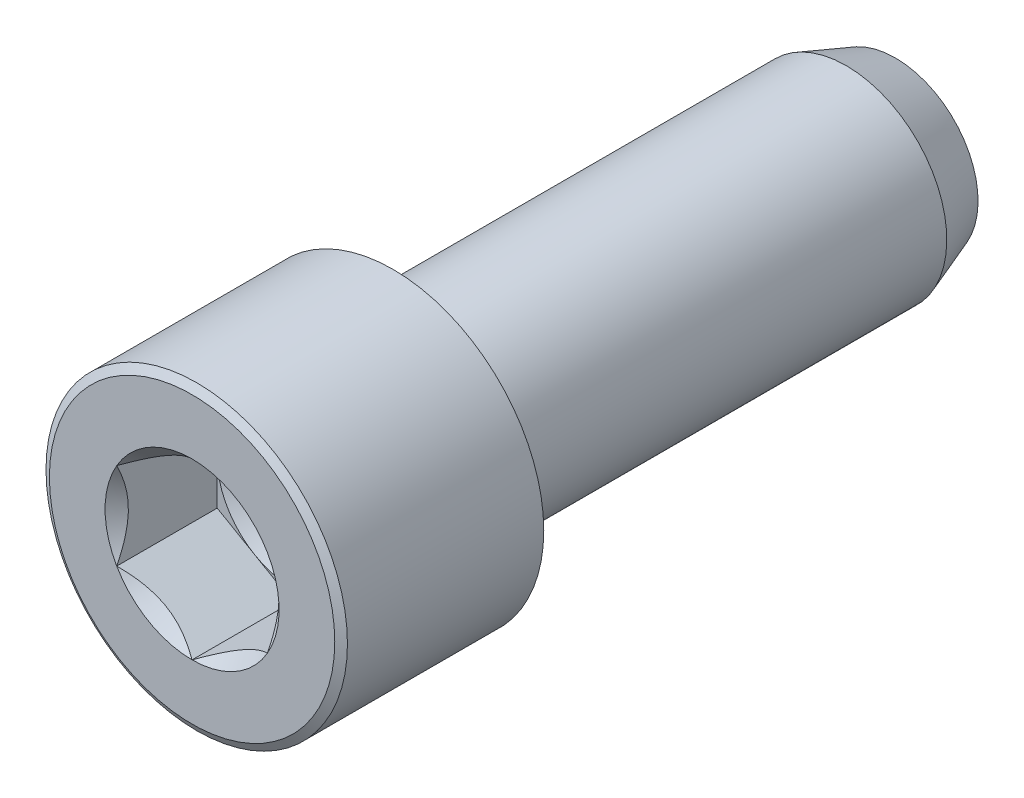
ISO-10303-21;
HEADER;
FILE_DESCRIPTION(('STEP AP214'),'2;1');
FILE_NAME('part.step','',(''),(''),'','','');
FILE_SCHEMA(('AUTOMOTIVE_DESIGN { 1 0 10303 214 1 1 1 1 }'));
ENDSEC;
DATA;
#1=APPLICATION_CONTEXT('core data for automotive mechanical design processes');
#2=APPLICATION_PROTOCOL_DEFINITION('international standard','automotive_design',2000,#1);
#3=PRODUCT_CONTEXT('',#1,'mechanical');
#4=PRODUCT('Part','Part','',(#3));
#5=PRODUCT_RELATED_PRODUCT_CATEGORY('part','',(#4));
#6=PRODUCT_DEFINITION_FORMATION('','',#4);
#7=PRODUCT_DEFINITION_CONTEXT('part definition',#1,'design');
#8=PRODUCT_DEFINITION('design','',#6,#7);
#9=PRODUCT_DEFINITION_SHAPE('','',#8);
#10=(LENGTH_UNIT() NAMED_UNIT(*) SI_UNIT(.MILLI.,.METRE.));
#11=(NAMED_UNIT(*) PLANE_ANGLE_UNIT() SI_UNIT($,.RADIAN.));
#12=(NAMED_UNIT(*) SI_UNIT($,.STERADIAN.) SOLID_ANGLE_UNIT());
#13=UNCERTAINTY_MEASURE_WITH_UNIT(LENGTH_MEASURE(1.E-05),#10,'distance_accuracy_value','');
#14=(GEOMETRIC_REPRESENTATION_CONTEXT(3) GLOBAL_UNCERTAINTY_ASSIGNED_CONTEXT((#13)) GLOBAL_UNIT_ASSIGNED_CONTEXT((#10,
#11,#12)) REPRESENTATION_CONTEXT('',''));
#15=CARTESIAN_POINT('',(0.,0.,0.));
#16=DIRECTION('',(0.,0.,1.));
#17=DIRECTION('',(1.,0.,0.));
#18=AXIS2_PLACEMENT_3D('',#15,#16,#17);
#19=CARTESIAN_POINT('',(-4.76249999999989,0.,3.17499999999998));
#20=DIRECTION('',(0.,0.,-0.999999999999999));
#21=DIRECTION('',(-1.,0.,0.));
#22=AXIS2_PLACEMENT_3D('',#19,#20,#21);
#23=PLANE('',#22);
#24=CARTESIAN_POINT('',(0.,0.,3.17499999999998));
#25=DIRECTION('',(0.,0.,0.999999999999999));
#26=DIRECTION('',(1.,0.,0.));
#27=AXIS2_PLACEMENT_3D('',#24,#25,#26);
#28=CIRCLE('',#27,2.38125);
#29=CARTESIAN_POINT('',(2.38125,0.,3.17499999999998));
#30=VERTEX_POINT('',#29);
#31=CARTESIAN_POINT('',(1.19062499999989,2.06222299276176,3.17499999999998));
#32=VERTEX_POINT('',#31);
#33=EDGE_CURVE('E51',#30,#32,#28,.T.);
#34=ORIENTED_EDGE('',*,*,#33,.F.);
#35=DIRECTION('',(0.,1.,0.));
#36=VECTOR('',#35,1.);
#37=CARTESIAN_POINT('',(2.38124999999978,-1.37481532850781,3.17499999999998));
#38=LINE('',#37,#36);
#39=CARTESIAN_POINT('',(2.38125,1.37481532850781,3.17499999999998));
#40=VERTEX_POINT('',#39);
#41=EDGE_CURVE('E121',#30,#40,#38,.T.);
#42=ORIENTED_EDGE('',*,*,#41,.T.);
#43=DIRECTION('',(-0.866025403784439,0.5,0.));
#44=VECTOR('',#43,1.);
#45=CARTESIAN_POINT('',(2.38125,1.37481532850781,3.17499999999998));
#46=LINE('',#45,#44);
#47=EDGE_CURVE('E124',#40,#32,#46,.T.);
#48=ORIENTED_EDGE('',*,*,#47,.T.);
#49=EDGE_LOOP('',(#34,#42,#48));
#50=FACE_BOUND('',#49,.T.);
#51=ADVANCED_FACE('F34',(#50),#23,.F.);
#52=CARTESIAN_POINT('',(-1.190625,2.06222299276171,3.17499999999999));
#53=VERTEX_POINT('',#52);
#54=EDGE_CURVE('E11',#32,#53,#28,.T.);
#55=ORIENTED_EDGE('',*,*,#54,.F.);
#56=CARTESIAN_POINT('',(0.,2.74963065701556,3.17499999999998));
#57=VERTEX_POINT('',#56);
#58=EDGE_CURVE('E138',#32,#57,#46,.T.);
#59=ORIENTED_EDGE('',*,*,#58,.T.);
#60=DIRECTION('',(-0.866025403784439,-0.5,0.));
#61=VECTOR('',#60,1.);
#62=CARTESIAN_POINT('',(0.,2.74963065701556,3.17499999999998));
#63=LINE('',#62,#61);
#64=EDGE_CURVE('E144',#57,#53,#63,.T.);
#65=ORIENTED_EDGE('',*,*,#64,.T.);
#66=EDGE_LOOP('',(#55,#59,#65));
#67=FACE_BOUND('',#66,.T.);
#68=ADVANCED_FACE('F300',(#67),#23,.F.);
#69=CARTESIAN_POINT('',(-2.38125,0.,3.17499999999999));
#70=VERTEX_POINT('',#69);
#71=EDGE_CURVE('E49',#53,#70,#28,.T.);
#72=ORIENTED_EDGE('',*,*,#71,.F.);
#73=CARTESIAN_POINT('',(-2.38125,1.37481532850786,3.17499999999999));
#74=VERTEX_POINT('',#73);
#75=EDGE_CURVE('E143',#53,#74,#63,.T.);
#76=ORIENTED_EDGE('',*,*,#75,.T.);
#77=DIRECTION('',(0.,-1.,0.));
#78=VECTOR('',#77,1.);
#79=CARTESIAN_POINT('',(-2.38125,1.37481532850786,3.17499999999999));
#80=LINE('',#79,#78);
#81=EDGE_CURVE('E148',#74,#70,#80,.T.);
#82=ORIENTED_EDGE('',*,*,#81,.T.);
#83=EDGE_LOOP('',(#72,#76,#82));
#84=FACE_BOUND('',#83,.T.);
#85=ADVANCED_FACE('F304',(#84),#23,.F.);
#86=CARTESIAN_POINT('',(-1.19062500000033,-2.06222299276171,3.17499999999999));
#87=VERTEX_POINT('',#86);
#88=EDGE_CURVE('E321',#70,#87,#28,.T.);
#89=ORIENTED_EDGE('',*,*,#88,.F.);
#90=CARTESIAN_POINT('',(-2.38125,-1.37481532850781,3.17499999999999));
#91=VERTEX_POINT('',#90);
#92=EDGE_CURVE('E147',#70,#91,#80,.T.);
#93=ORIENTED_EDGE('',*,*,#92,.T.);
#94=DIRECTION('',(0.866025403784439,-0.500000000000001,0.));
#95=VECTOR('',#94,1.);
#96=CARTESIAN_POINT('',(-2.38125,-1.37481532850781,3.17499999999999));
#97=LINE('',#96,#95);
#98=EDGE_CURVE('E241',#91,#87,#97,.T.);
#99=ORIENTED_EDGE('',*,*,#98,.T.);
#100=EDGE_LOOP('',(#89,#93,#99));
#101=FACE_BOUND('',#100,.T.);
#102=ADVANCED_FACE('F315',(#101),#23,.F.);
#103=CARTESIAN_POINT('',(1.19062499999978,-2.06222299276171,3.17499999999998));
#104=VERTEX_POINT('',#103);
#105=EDGE_CURVE('E58',#87,#104,#28,.T.);
#106=ORIENTED_EDGE('',*,*,#105,.F.);
#107=CARTESIAN_POINT('',(0.,-2.74963065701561,3.17499999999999));
#108=VERTEX_POINT('',#107);
#109=EDGE_CURVE('E225',#87,#108,#97,.T.);
#110=ORIENTED_EDGE('',*,*,#109,.T.);
#111=DIRECTION('',(0.866025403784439,0.5,0.));
#112=VECTOR('',#111,1.);
#113=CARTESIAN_POINT('',(0.,-2.74963065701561,3.17499999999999));
#114=LINE('',#113,#112);
#115=EDGE_CURVE('E133',#108,#104,#114,.T.);
#116=ORIENTED_EDGE('',*,*,#115,.T.);
#117=EDGE_LOOP('',(#106,#110,#116));
#118=FACE_BOUND('',#117,.T.);
#119=ADVANCED_FACE('F308',(#118),#23,.F.);
#120=EDGE_CURVE('E111',#104,#30,#28,.T.);
#121=ORIENTED_EDGE('',*,*,#120,.F.);
#122=CARTESIAN_POINT('',(2.38124999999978,-1.37481532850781,3.17499999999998));
#123=VERTEX_POINT('',#122);
#124=EDGE_CURVE('E136',#104,#123,#114,.T.);
#125=ORIENTED_EDGE('',*,*,#124,.T.);
#126=EDGE_CURVE('E129',#123,#30,#38,.T.);
#127=ORIENTED_EDGE('',*,*,#126,.T.);
#128=EDGE_LOOP('',(#121,#125,#127));
#129=FACE_BOUND('',#128,.T.);
#130=ADVANCED_FACE('F135',(#129),#23,.F.);
#131=CARTESIAN_POINT('',(0.,0.,0.));
#132=DIRECTION('',(0.,0.,-0.999999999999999));
#133=DIRECTION('',(0.,1.,0.));
#134=AXIS2_PLACEMENT_3D('',#131,#132,#133);
#135=CYLINDRICAL_SURFACE('',#134,3.175);
#136=CARTESIAN_POINT('',(0.,0.,-14.3224234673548));
#137=DIRECTION('',(0.,0.,-0.999999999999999));
#138=DIRECTION('',(0.,1.,0.));
#139=AXIS2_PLACEMENT_3D('',#136,#137,#138);
#140=CIRCLE('',#139,3.175);
#141=CARTESIAN_POINT('',(0.,3.175,-14.3224234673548));
#142=VERTEX_POINT('',#141);
#143=EDGE_CURVE('E175',#142,#142,#140,.T.);
#144=CARTESIAN_POINT('',(0.,0.,0.));
#145=DIRECTION('',(0.,0.,0.999999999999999));
#146=DIRECTION('',(1.,0.,0.));
#147=AXIS2_PLACEMENT_3D('',#144,#145,#146);
#148=CIRCLE('',#147,3.175);
#149=CARTESIAN_POINT('',(0.,3.175,0.));
#150=VERTEX_POINT('',#149);
#151=EDGE_CURVE('E169',#150,#150,#148,.F.);
#152=CARTESIAN_POINT('',(0.,3.175,-14.3224234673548));
#153=CARTESIAN_POINT('',(0.,3.175,-14.1732315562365));
#154=CARTESIAN_POINT('',(0.,3.175,-14.0240396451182));
#155=CARTESIAN_POINT('',(0.,3.175,-13.7256558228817));
#156=CARTESIAN_POINT('',(0.,3.175,-13.5764639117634));
#157=CARTESIAN_POINT('',(0.,3.175,-13.2780800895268));
#158=CARTESIAN_POINT('',(0.,3.175,-13.1288881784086));
#159=CARTESIAN_POINT('',(0.,3.175,-12.830504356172));
#160=CARTESIAN_POINT('',(0.,3.175,-12.6813124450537));
#161=CARTESIAN_POINT('',(0.,3.175,-12.3829286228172));
#162=CARTESIAN_POINT('',(0.,3.175,-12.2337367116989));
#163=CARTESIAN_POINT('',(0.,3.175,-11.9353528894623));
#164=CARTESIAN_POINT('',(0.,3.175,-11.786160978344));
#165=CARTESIAN_POINT('',(0.,3.175,-11.4877771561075));
#166=CARTESIAN_POINT('',(0.,3.175,-11.3385852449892));
#167=CARTESIAN_POINT('',(0.,3.175,-11.0402014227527));
#168=CARTESIAN_POINT('',(0.,3.175,-10.8910095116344));
#169=CARTESIAN_POINT('',(0.,3.175,-10.5926256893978));
#170=CARTESIAN_POINT('',(0.,3.175,-10.4434337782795));
#171=CARTESIAN_POINT('',(0.,3.175,-10.145049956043));
#172=CARTESIAN_POINT('',(0.,3.175,-9.9958580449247));
#173=CARTESIAN_POINT('',(0.,3.175,-9.69747422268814));
#174=CARTESIAN_POINT('',(0.,3.175,-9.54828231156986));
#175=CARTESIAN_POINT('',(0.,3.175,-9.24989848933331));
#176=CARTESIAN_POINT('',(0.,3.175,-9.10070657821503));
#177=CARTESIAN_POINT('',(0.,3.175,-8.80232275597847));
#178=CARTESIAN_POINT('',(0.,3.175,-8.65313084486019));
#179=CARTESIAN_POINT('',(0.,3.175,-8.35474702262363));
#180=CARTESIAN_POINT('',(0.,3.175,-8.20555511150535));
#181=CARTESIAN_POINT('',(0.,3.175,-7.90717128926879));
#182=CARTESIAN_POINT('',(0.,3.175,-7.75797937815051));
#183=CARTESIAN_POINT('',(0.,3.175,-7.45959555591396));
#184=CARTESIAN_POINT('',(0.,3.175,-7.31040364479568));
#185=CARTESIAN_POINT('',(0.,3.175,-7.01201982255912));
#186=CARTESIAN_POINT('',(0.,3.175,-6.86282791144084));
#187=CARTESIAN_POINT('',(0.,3.175,-6.56444408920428));
#188=CARTESIAN_POINT('',(0.,3.175,-6.415252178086));
#189=CARTESIAN_POINT('',(0.,3.175,-6.11686835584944));
#190=CARTESIAN_POINT('',(0.,3.175,-5.96767644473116));
#191=CARTESIAN_POINT('',(0.,3.175,-5.66929262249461));
#192=CARTESIAN_POINT('',(0.,3.175,-5.52010071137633));
#193=CARTESIAN_POINT('',(0.,3.175,-5.22171688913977));
#194=CARTESIAN_POINT('',(0.,3.175,-5.07252497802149));
#195=CARTESIAN_POINT('',(0.,3.175,-4.77414115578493));
#196=CARTESIAN_POINT('',(0.,3.175,-4.62494924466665));
#197=CARTESIAN_POINT('',(0.,3.175,-4.32656542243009));
#198=CARTESIAN_POINT('',(0.,3.175,-4.17737351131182));
#199=CARTESIAN_POINT('',(0.,3.175,-3.87898968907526));
#200=CARTESIAN_POINT('',(0.,3.175,-3.72979777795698));
#201=CARTESIAN_POINT('',(0.,3.175,-3.43141395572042));
#202=CARTESIAN_POINT('',(0.,3.175,-3.28222204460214));
#203=CARTESIAN_POINT('',(0.,3.175,-2.98383822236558));
#204=CARTESIAN_POINT('',(0.,3.175,-2.8346463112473));
#205=CARTESIAN_POINT('',(0.,3.175,-2.53626248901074));
#206=CARTESIAN_POINT('',(0.,3.175,-2.38707057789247));
#207=CARTESIAN_POINT('',(0.,3.175,-2.08868675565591));
#208=CARTESIAN_POINT('',(0.,3.175,-1.93949484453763));
#209=CARTESIAN_POINT('',(0.,3.175,-1.64111102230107));
#210=CARTESIAN_POINT('',(0.,3.175,-1.49191911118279));
#211=CARTESIAN_POINT('',(0.,3.175,-1.19353528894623));
#212=CARTESIAN_POINT('',(0.,3.175,-1.04434337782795));
#213=CARTESIAN_POINT('',(0.,3.175,-0.745959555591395));
#214=CARTESIAN_POINT('',(0.,3.175,-0.596767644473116));
#215=CARTESIAN_POINT('',(0.,3.175,-0.298383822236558));
#216=CARTESIAN_POINT('',(0.,3.175,-0.149191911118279));
#217=CARTESIAN_POINT('',(0.,3.175,0.));
#218=B_SPLINE_CURVE_WITH_KNOTS('',3,(#152,#153,#154,#155,#156,#157,#158,#159,#160,#161,#162,
#163,#164,#165,#166,#167,#168,#169,#170,#171,#172,#173,#174,#175,#176,#177,#178,#179,#180,#181,
#182,#183,#184,#185,#186,#187,#188,#189,#190,#191,#192,#193,#194,#195,#196,#197,#198,#199,#200,
#201,#202,#203,#204,#205,#206,#207,#208,#209,#210,#211,#212,#213,#214,#215,#216,#217),
.UNSPECIFIED.,.F.,.F.,(4,2,2,2,2,2,2,2,2,2,2,2,2,2,2,2,2,2,2,2,2,2,2,2,2,2,2,2,2,2,2,2,4),(0.,
0.447575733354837,0.895151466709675,1.34272720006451,1.79030293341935,2.23787866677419,
2.68545440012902,3.13303013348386,3.5806058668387,4.02818160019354,4.47575733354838,
4.92333306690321,5.37090880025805,5.81848453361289,6.26606026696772,6.71363600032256,
7.1612117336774,7.60878746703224,8.05636320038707,8.50393893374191,8.95151466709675,
9.39909040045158,9.84666613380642,10.2942418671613,10.7418176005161,11.1893933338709,
11.6369690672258,12.0845448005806,12.5321205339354,12.9796962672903,13.4272720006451,
13.874847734,14.3224234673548),.UNSPECIFIED.);
#219=EDGE_CURVE('BSEAM307',#142,#150,#218,.T.);
#220=ORIENTED_EDGE('',*,*,#143,.F.);
#221=ORIENTED_EDGE('',*,*,#151,.T.);
#222=ORIENTED_EDGE('',*,*,#219,.T.);
#223=ORIENTED_EDGE('',*,*,#219,.F.);
#224=EDGE_LOOP('',(#220,#222,#221,#223));
#225=FACE_BOUND('',#224,.T.);
#226=ADVANCED_FACE('F307',(#225),#135,.T.);
#227=CARTESIAN_POINT('',(0.,0.,-14.3224234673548));
#228=DIRECTION('',(0.,0.,0.999999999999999));
#229=DIRECTION('',(0.,-1.,0.));
#230=AXIS2_PLACEMENT_3D('',#227,#228,#229);
#231=CONICAL_SURFACE('',#230,3.175,0.349065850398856);
#232=CARTESIAN_POINT('',(0.,0.,-15.875));
#233=DIRECTION('',(0.,0.,-0.999999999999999));
#234=DIRECTION('',(0.,1.,0.));
#235=AXIS2_PLACEMENT_3D('',#232,#233,#234);
#236=CIRCLE('',#235,2.60990835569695);
#237=CARTESIAN_POINT('',(0.,2.60990835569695,-15.875));
#238=VERTEX_POINT('',#237);
#239=EDGE_CURVE('E172',#238,#238,#236,.T.);
#240=ORIENTED_EDGE('',*,*,#239,.F.);
#241=EDGE_LOOP('',(#240));
#242=FACE_BOUND('',#241,.T.);
#243=ORIENTED_EDGE('',*,*,#143,.T.);
#244=EDGE_LOOP('',(#243));
#245=FACE_BOUND('',#244,.T.);
#246=ADVANCED_FACE('F313',(#242,#245),#231,.T.);
#247=CARTESIAN_POINT('',(0.,0.,-15.875));
#248=DIRECTION('',(0.,0.,-0.999999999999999));
#249=DIRECTION('',(0.,1.,0.));
#250=AXIS2_PLACEMENT_3D('',#247,#248,#249);
#251=PLANE('',#250);
#252=ORIENTED_EDGE('',*,*,#239,.T.);
#253=EDGE_LOOP('',(#252));
#254=FACE_BOUND('',#253,.T.);
#255=ADVANCED_FACE('F356',(#254),#251,.T.);
#256=CARTESIAN_POINT('',(3.33066907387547E-13,0.,6.35000000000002));
#257=DIRECTION('',(0.,0.,-0.999999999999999));
#258=DIRECTION('',(-1.,0.,0.));
#259=AXIS2_PLACEMENT_3D('',#256,#257,#258);
#260=CYLINDRICAL_SURFACE('',#259,4.7625);
#261=CARTESIAN_POINT('',(3.33066907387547E-13,0.,6.20335303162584));
#262=DIRECTION('',(0.,0.,0.999999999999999));
#263=DIRECTION('',(1.,0.,0.));
#264=AXIS2_PLACEMENT_3D('',#261,#262,#263);
#265=CIRCLE('',#264,4.7625);
#266=CARTESIAN_POINT('',(-4.76249999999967,0.,6.20335303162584));
#267=VERTEX_POINT('',#266);
#268=EDGE_CURVE('E180',#267,#267,#265,.F.);
#269=CARTESIAN_POINT('',(0.,0.,0.));
#270=DIRECTION('',(0.,0.,0.999999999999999));
#271=DIRECTION('',(1.,0.,0.));
#272=AXIS2_PLACEMENT_3D('',#269,#270,#271);
#273=CIRCLE('',#272,4.7625);
#274=CARTESIAN_POINT('',(-4.76249999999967,0.,0.));
#275=VERTEX_POINT('',#274);
#276=EDGE_CURVE('E155',#275,#275,#273,.T.);
#277=CARTESIAN_POINT('',(-4.76249999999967,0.,6.20335303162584));
#278=CARTESIAN_POINT('',(-4.76249999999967,0.,6.13873477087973));
#279=CARTESIAN_POINT('',(-4.76249999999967,0.,6.07411651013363));
#280=CARTESIAN_POINT('',(-4.76249999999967,0.,5.94487998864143));
#281=CARTESIAN_POINT('',(-4.76249999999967,0.,5.88026172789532));
#282=CARTESIAN_POINT('',(-4.76249999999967,0.,5.75102520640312));
#283=CARTESIAN_POINT('',(-4.76249999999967,0.,5.68640694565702));
#284=CARTESIAN_POINT('',(-4.76249999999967,0.,5.55717042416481));
#285=CARTESIAN_POINT('',(-4.76249999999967,0.,5.49255216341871));
#286=CARTESIAN_POINT('',(-4.76249999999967,0.,5.3633156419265));
#287=CARTESIAN_POINT('',(-4.76249999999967,0.,5.2986973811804));
#288=CARTESIAN_POINT('',(-4.76249999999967,0.,5.1694608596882));
#289=CARTESIAN_POINT('',(-4.76249999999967,0.,5.10484259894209));
#290=CARTESIAN_POINT('',(-4.76249999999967,0.,4.97560607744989));
#291=CARTESIAN_POINT('',(-4.76249999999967,0.,4.91098781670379));
#292=CARTESIAN_POINT('',(-4.76249999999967,0.,4.78175129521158));
#293=CARTESIAN_POINT('',(-4.76249999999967,0.,4.71713303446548));
#294=CARTESIAN_POINT('',(-4.76249999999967,0.,4.58789651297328));
#295=CARTESIAN_POINT('',(-4.76249999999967,0.,4.52327825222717));
#296=CARTESIAN_POINT('',(-4.76249999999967,0.,4.39404173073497));
#297=CARTESIAN_POINT('',(-4.76249999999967,0.,4.32942346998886));
#298=CARTESIAN_POINT('',(-4.76249999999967,0.,4.20018694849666));
#299=CARTESIAN_POINT('',(-4.76249999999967,0.,4.13556868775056));
#300=CARTESIAN_POINT('',(-4.76249999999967,0.,4.00633216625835));
#301=CARTESIAN_POINT('',(-4.76249999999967,0.,3.94171390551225));
#302=CARTESIAN_POINT('',(-4.76249999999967,0.,3.81247738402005));
#303=CARTESIAN_POINT('',(-4.76249999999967,0.,3.74785912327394));
#304=CARTESIAN_POINT('',(-4.76249999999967,0.,3.61862260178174));
#305=CARTESIAN_POINT('',(-4.76249999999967,0.,3.55400434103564));
#306=CARTESIAN_POINT('',(-4.76249999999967,0.,3.42476781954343));
#307=CARTESIAN_POINT('',(-4.76249999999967,0.,3.36014955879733));
#308=CARTESIAN_POINT('',(-4.76249999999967,0.,3.23091303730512));
#309=CARTESIAN_POINT('',(-4.76249999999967,0.,3.16629477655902));
#310=CARTESIAN_POINT('',(-4.76249999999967,0.,3.03705825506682));
#311=CARTESIAN_POINT('',(-4.76249999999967,0.,2.97243999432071));
#312=CARTESIAN_POINT('',(-4.76249999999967,0.,2.84320347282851));
#313=CARTESIAN_POINT('',(-4.76249999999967,0.,2.77858521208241));
#314=CARTESIAN_POINT('',(-4.76249999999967,0.,2.6493486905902));
#315=CARTESIAN_POINT('',(-4.76249999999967,0.,2.5847304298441));
#316=CARTESIAN_POINT('',(-4.76249999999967,0.,2.45549390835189));
#317=CARTESIAN_POINT('',(-4.76249999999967,0.,2.39087564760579));
#318=CARTESIAN_POINT('',(-4.76249999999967,0.,2.26163912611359));
#319=CARTESIAN_POINT('',(-4.76249999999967,0.,2.19702086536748));
#320=CARTESIAN_POINT('',(-4.76249999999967,0.,2.06778434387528));
#321=CARTESIAN_POINT('',(-4.76249999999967,0.,2.00316608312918));
#322=CARTESIAN_POINT('',(-4.76249999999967,0.,1.87392956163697));
#323=CARTESIAN_POINT('',(-4.76249999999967,0.,1.80931130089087));
#324=CARTESIAN_POINT('',(-4.76249999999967,0.,1.68007477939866));
#325=CARTESIAN_POINT('',(-4.76249999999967,0.,1.61545651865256));
#326=CARTESIAN_POINT('',(-4.76249999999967,0.,1.48621999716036));
#327=CARTESIAN_POINT('',(-4.76249999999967,0.,1.42160173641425));
#328=CARTESIAN_POINT('',(-4.76249999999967,0.,1.29236521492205));
#329=CARTESIAN_POINT('',(-4.76249999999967,0.,1.22774695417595));
#330=CARTESIAN_POINT('',(-4.76249999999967,0.,1.09851043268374));
#331=CARTESIAN_POINT('',(-4.76249999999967,0.,1.03389217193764));
#332=CARTESIAN_POINT('',(-4.76249999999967,0.,0.904655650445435));
#333=CARTESIAN_POINT('',(-4.76249999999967,0.,0.840037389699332));
#334=CARTESIAN_POINT('',(-4.76249999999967,0.,0.710800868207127));
#335=CARTESIAN_POINT('',(-4.76249999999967,0.,0.646182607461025));
#336=CARTESIAN_POINT('',(-4.76249999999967,0.,0.51694608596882));
#337=CARTESIAN_POINT('',(-4.76249999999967,0.,0.452327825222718));
#338=CARTESIAN_POINT('',(-4.76249999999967,0.,0.323091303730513));
#339=CARTESIAN_POINT('',(-4.76249999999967,0.,0.258473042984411));
#340=CARTESIAN_POINT('',(-4.76249999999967,0.,0.129236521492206));
#341=CARTESIAN_POINT('',(-4.76249999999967,0.,0.0646182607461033));
#342=CARTESIAN_POINT('',(-4.76249999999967,0.,0.));
#343=B_SPLINE_CURVE_WITH_KNOTS('',3,(#277,#278,#279,#280,#281,#282,#283,#284,#285,#286,#287,
#288,#289,#290,#291,#292,#293,#294,#295,#296,#297,#298,#299,#300,#301,#302,#303,#304,#305,#306,
#307,#308,#309,#310,#311,#312,#313,#314,#315,#316,#317,#318,#319,#320,#321,#322,#323,#324,#325,
#326,#327,#328,#329,#330,#331,#332,#333,#334,#335,#336,#337,#338,#339,#340,#341,#342),
.UNSPECIFIED.,.F.,.F.,(4,2,2,2,2,2,2,2,2,2,2,2,2,2,2,2,2,2,2,2,2,2,2,2,2,2,2,2,2,2,2,2,4),(0.,
0.193854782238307,0.387709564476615,0.581564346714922,0.775419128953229,0.969273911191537,
1.16312869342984,1.35698347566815,1.55083825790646,1.74469304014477,1.93854782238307,
2.13240260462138,2.32625738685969,2.52011216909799,2.7139669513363,2.90782173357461,
3.10167651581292,3.29553129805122,3.48938608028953,3.68324086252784,3.87709564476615,
4.07095042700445,4.26480520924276,4.45865999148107,4.65251477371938,4.84636955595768,
5.04022433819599,5.2340791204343,5.42793390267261,5.62178868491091,5.81564346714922,
6.00949824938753,6.20335303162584),.UNSPECIFIED.);
#344=EDGE_CURVE('BSEAM352',#267,#275,#343,.T.);
#345=ORIENTED_EDGE('',*,*,#268,.T.);
#346=ORIENTED_EDGE('',*,*,#276,.T.);
#347=ORIENTED_EDGE('',*,*,#344,.T.);
#348=ORIENTED_EDGE('',*,*,#344,.F.);
#349=EDGE_LOOP('',(#345,#347,#346,#348));
#350=FACE_BOUND('',#349,.T.);
#351=ADVANCED_FACE('F352',(#350),#260,.T.);
#352=CARTESIAN_POINT('',(3.33066907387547E-13,0.,6.35000000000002));
#353=DIRECTION('',(0.,0.,0.999999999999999));
#354=DIRECTION('',(1.,0.,0.));
#355=AXIS2_PLACEMENT_3D('',#352,#353,#354);
#356=PLANE('',#355);
#357=CARTESIAN_POINT('',(3.33066907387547E-13,0.,6.35000000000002));
#358=DIRECTION('',(0.,0.,0.999999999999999));
#359=DIRECTION('',(1.,0.,0.));
#360=AXIS2_PLACEMENT_3D('',#357,#358,#359);
#361=CIRCLE('',#360,2.74963065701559);
#362=CARTESIAN_POINT('',(2.38125000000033,1.37481532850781,6.35000000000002));
#363=VERTEX_POINT('',#362);
#364=CARTESIAN_POINT('',(1.11022302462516E-13,2.74963065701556,6.35000000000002));
#365=VERTEX_POINT('',#364);
#366=EDGE_CURVE('E208',#363,#365,#361,.T.);
#367=ORIENTED_EDGE('',*,*,#366,.F.);
#368=CARTESIAN_POINT('',(2.38125,-1.37481532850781,6.35000000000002));
#369=VERTEX_POINT('',#368);
#370=EDGE_CURVE('E201',#369,#363,#361,.T.);
#371=ORIENTED_EDGE('',*,*,#370,.F.);
#372=CARTESIAN_POINT('',(2.22044604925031E-13,-2.74963065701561,6.35000000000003));
#373=VERTEX_POINT('',#372);
#374=EDGE_CURVE('E194',#373,#369,#361,.T.);
#375=ORIENTED_EDGE('',*,*,#374,.F.);
#376=CARTESIAN_POINT('',(-2.38124999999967,-1.37481532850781,6.35000000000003));
#377=VERTEX_POINT('',#376);
#378=EDGE_CURVE('E200',#377,#373,#361,.T.);
#379=ORIENTED_EDGE('',*,*,#378,.F.);
#380=CARTESIAN_POINT('',(-2.38124999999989,1.37481532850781,6.35000000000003));
#381=VERTEX_POINT('',#380);
#382=EDGE_CURVE('E65',#381,#377,#361,.T.);
#383=ORIENTED_EDGE('',*,*,#382,.F.);
#384=EDGE_CURVE('E216',#365,#381,#361,.T.);
#385=ORIENTED_EDGE('',*,*,#384,.F.);
#386=EDGE_LOOP('',(#367,#371,#375,#379,#383,#385));
#387=FACE_BOUND('',#386,.T.);
#388=CARTESIAN_POINT('',(3.33066907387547E-13,0.,6.35000000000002));
#389=DIRECTION('',(0.,0.,0.999999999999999));
#390=DIRECTION('',(1.,0.,0.));
#391=AXIS2_PLACEMENT_3D('',#388,#389,#390);
#392=CIRCLE('',#391,4.5085);
#393=CARTESIAN_POINT('',(-4.50849999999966,0.,6.35000000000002));
#394=VERTEX_POINT('',#393);
#395=EDGE_CURVE('E178',#394,#394,#392,.T.);
#396=ORIENTED_EDGE('',*,*,#395,.T.);
#397=EDGE_LOOP('',(#396));
#398=FACE_BOUND('',#397,.T.);
#399=ADVANCED_FACE('F211',(#387,#398),#356,.T.);
#400=CARTESIAN_POINT('',(0.,0.,0.));
#401=DIRECTION('',(0.,0.,0.999999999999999));
#402=DIRECTION('',(1.,0.,0.));
#403=AXIS2_PLACEMENT_3D('',#400,#401,#402);
#404=PLANE('',#403);
#405=ORIENTED_EDGE('',*,*,#151,.F.);
#406=EDGE_LOOP('',(#405));
#407=FACE_BOUND('',#406,.T.);
#408=ORIENTED_EDGE('',*,*,#276,.F.);
#409=EDGE_LOOP('',(#408));
#410=FACE_BOUND('',#409,.T.);
#411=ADVANCED_FACE('F342',(#407,#410),#404,.F.);
#412=CARTESIAN_POINT('',(3.33066907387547E-13,0.,6.35000000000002));
#413=DIRECTION('',(0.,0.,-0.999999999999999));
#414=DIRECTION('',(-1.,0.,0.));
#415=AXIS2_PLACEMENT_3D('',#412,#413,#414);
#416=CONICAL_SURFACE('',#415,4.5085,1.0471975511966);
#417=CARTESIAN_POINT('',(-4.76249999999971,0.,6.20335303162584));
#418=CARTESIAN_POINT('',(-4.75985416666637,0.,6.20488060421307));
#419=CARTESIAN_POINT('',(-4.75720833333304,0.,6.2064081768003));
#420=CARTESIAN_POINT('',(-4.75191666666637,0.,6.20946332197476));
#421=CARTESIAN_POINT('',(-4.74927083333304,0.,6.21099089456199));
#422=CARTESIAN_POINT('',(-4.74397916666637,0.,6.21404603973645));
#423=CARTESIAN_POINT('',(-4.74133333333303,0.,6.21557361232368));
#424=CARTESIAN_POINT('',(-4.73604166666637,0.,6.21862875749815));
#425=CARTESIAN_POINT('',(-4.73339583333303,0.,6.22015633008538));
#426=CARTESIAN_POINT('',(-4.72810416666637,0.,6.22321147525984));
#427=CARTESIAN_POINT('',(-4.72545833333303,0.,6.22473904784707));
#428=CARTESIAN_POINT('',(-4.72016666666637,0.,6.22779419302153));
#429=CARTESIAN_POINT('',(-4.71752083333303,0.,6.22932176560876));
#430=CARTESIAN_POINT('',(-4.71222916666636,0.,6.23237691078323));
#431=CARTESIAN_POINT('',(-4.70958333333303,0.,6.23390448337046));
#432=CARTESIAN_POINT('',(-4.70429166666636,0.,6.23695962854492));
#433=CARTESIAN_POINT('',(-4.70164583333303,0.,6.23848720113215));
#434=CARTESIAN_POINT('',(-4.69635416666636,0.,6.24154234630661));
#435=CARTESIAN_POINT('',(-4.69370833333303,0.,6.24306991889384));
#436=CARTESIAN_POINT('',(-4.68841666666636,0.,6.24612506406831));
#437=CARTESIAN_POINT('',(-4.68577083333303,0.,6.24765263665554));
#438=CARTESIAN_POINT('',(-4.68047916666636,0.,6.25070778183));
#439=CARTESIAN_POINT('',(-4.67783333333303,0.,6.25223535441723));
#440=CARTESIAN_POINT('',(-4.67254166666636,0.,6.25529049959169));
#441=CARTESIAN_POINT('',(-4.66989583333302,0.,6.25681807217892));
#442=CARTESIAN_POINT('',(-4.66460416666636,0.,6.25987321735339));
#443=CARTESIAN_POINT('',(-4.66195833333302,0.,6.26140078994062));
#444=CARTESIAN_POINT('',(-4.65666666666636,0.,6.26445593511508));
#445=CARTESIAN_POINT('',(-4.65402083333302,0.,6.26598350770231));
#446=CARTESIAN_POINT('',(-4.64872916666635,0.,6.26903865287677));
#447=CARTESIAN_POINT('',(-4.64608333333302,0.,6.270566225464));
#448=CARTESIAN_POINT('',(-4.64079166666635,0.,6.27362137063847));
#449=CARTESIAN_POINT('',(-4.63814583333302,0.,6.2751489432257));
#450=CARTESIAN_POINT('',(-4.63285416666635,0.,6.27820408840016));
#451=CARTESIAN_POINT('',(-4.63020833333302,0.,6.27973166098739));
#452=CARTESIAN_POINT('',(-4.62491666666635,0.,6.28278680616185));
#453=CARTESIAN_POINT('',(-4.62227083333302,0.,6.28431437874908));
#454=CARTESIAN_POINT('',(-4.61697916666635,0.,6.28736952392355));
#455=CARTESIAN_POINT('',(-4.61433333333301,0.,6.28889709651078));
#456=CARTESIAN_POINT('',(-4.60904166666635,0.,6.29195224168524));
#457=CARTESIAN_POINT('',(-4.60639583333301,0.,6.29347981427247));
#458=CARTESIAN_POINT('',(-4.60110416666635,0.,6.29653495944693));
#459=CARTESIAN_POINT('',(-4.59845833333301,0.,6.29806253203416));
#460=CARTESIAN_POINT('',(-4.59316666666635,0.,6.30111767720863));
#461=CARTESIAN_POINT('',(-4.59052083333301,0.,6.30264524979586));
#462=CARTESIAN_POINT('',(-4.58522916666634,0.,6.30570039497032));
#463=CARTESIAN_POINT('',(-4.58258333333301,0.,6.30722796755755));
#464=CARTESIAN_POINT('',(-4.57729166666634,0.,6.31028311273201));
#465=CARTESIAN_POINT('',(-4.57464583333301,0.,6.31181068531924));
#466=CARTESIAN_POINT('',(-4.56935416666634,0.,6.31486583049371));
#467=CARTESIAN_POINT('',(-4.56670833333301,0.,6.31639340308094));
#468=CARTESIAN_POINT('',(-4.56141666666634,0.,6.3194485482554));
#469=CARTESIAN_POINT('',(-4.55877083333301,0.,6.32097612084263));
#470=CARTESIAN_POINT('',(-4.55347916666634,0.,6.32403126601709));
#471=CARTESIAN_POINT('',(-4.550833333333,0.,6.32555883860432));
#472=CARTESIAN_POINT('',(-4.54554166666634,0.,6.32861398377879));
#473=CARTESIAN_POINT('',(-4.542895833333,0.,6.33014155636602));
#474=CARTESIAN_POINT('',(-4.53760416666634,0.,6.33319670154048));
#475=CARTESIAN_POINT('',(-4.534958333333,0.,6.33472427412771));
#476=CARTESIAN_POINT('',(-4.52966666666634,0.,6.33777941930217));
#477=CARTESIAN_POINT('',(-4.527020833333,0.,6.3393069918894));
#478=CARTESIAN_POINT('',(-4.52172916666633,0.,6.34236213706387));
#479=CARTESIAN_POINT('',(-4.519083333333,0.,6.3438897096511));
#480=CARTESIAN_POINT('',(-4.51379166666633,0.,6.34694485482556));
#481=CARTESIAN_POINT('',(-4.511145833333,0.,6.34847242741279));
#482=CARTESIAN_POINT('',(-4.50849999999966,0.,6.35000000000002));
#483=B_SPLINE_CURVE_WITH_KNOTS('',3,(#417,#418,#419,#420,#421,#422,#423,#424,#425,#426,#427,
#428,#429,#430,#431,#432,#433,#434,#435,#436,#437,#438,#439,#440,#441,#442,#443,#444,#445,#446,
#447,#448,#449,#450,#451,#452,#453,#454,#455,#456,#457,#458,#459,#460,#461,#462,#463,#464,#465,
#466,#467,#468,#469,#470,#471,#472,#473,#474,#475,#476,#477,#478,#479,#480,#481,#482),
.UNSPECIFIED.,.F.,.F.,(4,2,2,2,2,2,2,2,2,2,2,2,2,2,2,2,2,2,2,2,2,2,2,2,2,2,2,2,2,2,2,2,4),(0.,
0.00916543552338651,0.018330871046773,0.0274963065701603,0.0366617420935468,0.0458271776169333,
0.0549926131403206,0.0641580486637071,0.0733234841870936,0.0824889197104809,0.0916543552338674,
0.100819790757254,0.10998522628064,0.119150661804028,0.128316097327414,0.137481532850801,
0.146646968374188,0.155812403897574,0.164977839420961,0.174143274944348,0.183308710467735,
0.192474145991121,0.201639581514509,0.210805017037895,0.219970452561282,0.229135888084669,
0.238301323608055,0.247466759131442,0.25663219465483,0.265797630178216,0.274963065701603,
0.28412850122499,0.293293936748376),.UNSPECIFIED.);
#484=EDGE_CURVE('BSEAM36',#267,#394,#483,.T.);
#485=ORIENTED_EDGE('',*,*,#268,.F.);
#486=ORIENTED_EDGE('',*,*,#395,.F.);
#487=ORIENTED_EDGE('',*,*,#484,.T.);
#488=ORIENTED_EDGE('',*,*,#484,.F.);
#489=EDGE_LOOP('',(#485,#487,#486,#488));
#490=FACE_BOUND('',#489,.T.);
#491=ADVANCED_FACE('F36',(#490),#416,.T.);
#492=CARTESIAN_POINT('',(3.33066907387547E-13,0.,6.35000000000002));
#493=DIRECTION('',(0.,0.,0.999999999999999));
#494=DIRECTION('',(1.,0.,0.));
#495=AXIS2_PLACEMENT_3D('',#492,#493,#494);
#496=CONICAL_SURFACE('',#495,2.74963065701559,0.78539816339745);
#497=ORIENTED_EDGE('',*,*,#374,.T.);
#498=CARTESIAN_POINT('',(-0.000200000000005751,-2.74974612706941,6.35011547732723));
#499=CARTESIAN_POINT('',(0.08165678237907,-2.70248609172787,6.30289489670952));
#500=CARTESIAN_POINT('',(0.164882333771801,-2.65443579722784,6.25844757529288));
#501=CARTESIAN_POINT('',(0.3345884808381,-2.556455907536,6.17706545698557));
#502=CARTESIAN_POINT('',(0.42108521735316,-2.506516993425,6.14017594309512));
#503=CARTESIAN_POINT('',(0.595501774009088,-2.40581754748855,6.07698341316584));
#504=CARTESIAN_POINT('',(0.683377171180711,-2.35508266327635,6.05052155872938));
#505=CARTESIAN_POINT('',(0.861062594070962,-2.25249593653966,6.009751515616));
#506=CARTESIAN_POINT('',(0.950867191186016,-2.2006472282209,5.99541289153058));
#507=CARTESIAN_POINT('',(1.10563960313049,-2.1112893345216,5.9824757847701));
#508=CARTESIAN_POINT('',(1.17040744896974,-2.07389560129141,5.98056060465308));
#509=CARTESIAN_POINT('',(1.29983727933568,-1.99916925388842,5.98378662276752));
#510=CARTESIAN_POINT('',(1.36449921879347,-1.96183666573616,5.98893029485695));
#511=CARTESIAN_POINT('',(1.49321254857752,-1.88752399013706,6.00598131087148));
#512=CARTESIAN_POINT('',(1.55726317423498,-1.85054434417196,6.01789622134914));
#513=CARTESIAN_POINT('',(1.68425683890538,-1.77722451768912,6.04783567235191));
#514=CARTESIAN_POINT('',(1.74719996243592,-1.74088428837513,6.06585974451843));
#515=CARTESIAN_POINT('',(1.90842615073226,-1.64780030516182,6.11936880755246));
#516=CARTESIAN_POINT('',(2.00570949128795,-1.59163374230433,6.15888742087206));
#517=CARTESIAN_POINT('',(2.14875606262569,-1.50904576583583,6.22560034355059));
#518=CARTESIAN_POINT('',(2.19589628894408,-1.48182934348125,6.24904020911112));
#519=CARTESIAN_POINT('',(2.28930352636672,-1.42790064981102,6.29805667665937));
#520=CARTESIAN_POINT('',(2.33557105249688,-1.40118808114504,6.32363196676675));
#521=CARTESIAN_POINT('',(2.38145000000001,-1.37469985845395,6.35011547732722));
#522=B_SPLINE_CURVE_WITH_KNOTS('',3,(#498,#499,#500,#501,#502,#503,#504,#505,#506,#507,#508,
#509,#510,#511,#512,#513,#514,#515,#516,#517,#518,#519,#520,#521),.UNSPECIFIED.,.F.,.F.,(4,2,2,
2,2,2,2,2,2,2,2,4),(0.,0.317196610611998,0.636241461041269,0.95021895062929,1.26340583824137,
1.48752413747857,1.7117210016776,1.93616888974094,2.1605995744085,2.51709639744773,
2.69486147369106,2.87251813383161),.UNSPECIFIED.);
#523=EDGE_CURVE('E38',#373,#369,#522,.T.);
#524=ORIENTED_EDGE('',*,*,#523,.F.);
#525=EDGE_LOOP('',(#497,#524));
#526=FACE_BOUND('',#525,.T.);
#527=ADVANCED_FACE('F196',(#526),#496,.F.);
#528=ORIENTED_EDGE('',*,*,#370,.T.);
#529=CARTESIAN_POINT('',(2.38125,-2.74194290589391,7.23198089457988));
#530=CARTESIAN_POINT('',(2.38124999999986,-2.67517961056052,7.18158466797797));
#531=CARTESIAN_POINT('',(2.3812499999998,-2.60804251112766,7.13167558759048));
#532=CARTESIAN_POINT('',(2.38124999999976,-2.47287325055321,7.03304983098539));
#533=CARTESIAN_POINT('',(2.38124999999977,-2.40484086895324,6.98433345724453));
#534=CARTESIAN_POINT('',(2.38124999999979,-2.26723593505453,6.88796485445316));
#535=CARTESIAN_POINT('',(2.38124999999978,-2.19765553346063,6.84032379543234));
#536=CARTESIAN_POINT('',(2.38124999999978,-2.0573136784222,6.74681992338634));
#537=CARTESIAN_POINT('',(2.38124999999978,-1.98655230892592,6.70095698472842));
#538=CARTESIAN_POINT('',(2.38124999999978,-1.83957751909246,6.60884590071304));
#539=CARTESIAN_POINT('',(2.38124999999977,-1.76328361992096,6.56272551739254));
#540=CARTESIAN_POINT('',(2.38124999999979,-1.60891357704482,6.47351830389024));
#541=CARTESIAN_POINT('',(2.3812499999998,-1.53083712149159,6.4304320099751));
#542=CARTESIAN_POINT('',(2.38124999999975,-1.37291620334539,6.34822650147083));
#543=CARTESIAN_POINT('',(2.38124999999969,-1.29307799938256,6.30909535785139));
#544=CARTESIAN_POINT('',(2.38124999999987,-1.13121425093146,6.23566795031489));
#545=CARTESIAN_POINT('',(2.38125000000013,-1.04918943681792,6.20137009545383));
#546=CARTESIAN_POINT('',(2.3812500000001,-0.889535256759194,6.14135463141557));
#547=CARTESIAN_POINT('',(2.38124999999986,-0.812083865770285,6.11516847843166));
#548=CARTESIAN_POINT('',(2.3812499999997,-0.655316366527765,6.06900975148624));
#549=CARTESIAN_POINT('',(2.38124999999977,-0.576000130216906,6.04903760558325));
#550=CARTESIAN_POINT('',(2.38124999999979,-0.41729576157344,6.01668214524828));
#551=CARTESIAN_POINT('',(2.38124999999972,-0.337934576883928,6.00416880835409));
#552=CARTESIAN_POINT('',(2.38124999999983,-0.178363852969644,5.98697386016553));
#553=CARTESIAN_POINT('',(2.38125,-0.0981544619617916,5.98229090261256));
#554=CARTESIAN_POINT('',(2.38125,0.0594188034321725,5.98110444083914));
#555=CARTESIAN_POINT('',(2.38124999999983,0.136780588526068,5.9843110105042));
#556=CARTESIAN_POINT('',(2.38124999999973,0.290840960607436,5.99808705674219));
#557=CARTESIAN_POINT('',(2.38124999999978,0.367539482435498,6.00865724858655));
#558=CARTESIAN_POINT('',(2.38124999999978,0.52101749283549,6.03676282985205));
#559=CARTESIAN_POINT('',(2.38124999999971,0.597774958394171,6.05441674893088));
#560=CARTESIAN_POINT('',(2.38124999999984,0.74960981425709,6.09575139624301));
#561=CARTESIAN_POINT('',(2.38125000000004,0.824687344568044,6.11943162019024));
#562=CARTESIAN_POINT('',(2.38125000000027,1.06107814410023,6.20289486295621));
#563=CARTESIAN_POINT('',(2.38124999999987,1.2190478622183,6.27218392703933));
#564=CARTESIAN_POINT('',(2.38124999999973,1.45021000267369,6.38766408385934));
#565=CARTESIAN_POINT('',(2.38124999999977,1.52644290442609,6.42817305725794));
#566=CARTESIAN_POINT('',(2.38124999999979,1.67717618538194,6.5123026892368));
#567=CARTESIAN_POINT('',(2.38124999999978,1.75167687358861,6.55592278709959));
#568=CARTESIAN_POINT('',(2.38124999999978,1.89548152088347,6.64341255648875));
#569=CARTESIAN_POINT('',(2.38124999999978,1.96485959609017,6.68716179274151));
#570=CARTESIAN_POINT('',(2.38124999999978,2.10242624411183,6.77650115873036));
#571=CARTESIAN_POINT('',(2.38124999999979,2.17061472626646,6.82209142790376));
#572=CARTESIAN_POINT('',(2.38124999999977,2.30540317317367,6.91440600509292));
#573=CARTESIAN_POINT('',(2.38124999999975,2.37201154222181,6.9611180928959));
#574=CARTESIAN_POINT('',(2.38124999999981,2.50431800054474,7.05577757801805));
#575=CARTESIAN_POINT('',(2.3812499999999,2.57001633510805,7.10372463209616));
#576=CARTESIAN_POINT('',(2.38125000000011,2.63533378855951,7.15217673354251));
#577=B_SPLINE_CURVE_WITH_KNOTS('',3,(#529,#530,#531,#532,#533,#534,#535,#536,#537,#538,#539,
#540,#541,#542,#543,#544,#545,#546,#547,#548,#549,#550,#551,#552,#553,#554,#555,#556,#557,#558,
#559,#560,#561,#562,#563,#564,#565,#566,#567,#568,#569,#570,#571,#572,#573,#574,#575,#576),
.UNSPECIFIED.,.F.,.F.,(4,2,2,2,2,2,2,2,2,2,2,2,2,2,2,2,2,2,2,2,2,2,2,4),(0.,0.250951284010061,
0.501965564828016,0.75492477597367,1.00786608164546,1.27526207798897,1.54270521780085,
1.80931602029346,2.07583885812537,2.32089852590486,2.56597507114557,2.80664400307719,
3.04727155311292,3.27918940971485,3.51112979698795,3.74712477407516,3.98310000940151,
4.49898139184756,4.75794323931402,5.01685853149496,5.26288960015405,5.50893933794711,
5.75299038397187,5.99697431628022),.UNSPECIFIED.);
#578=EDGE_CURVE('E204',#369,#363,#577,.T.);
#579=ORIENTED_EDGE('',*,*,#578,.F.);
#580=EDGE_LOOP('',(#528,#579));
#581=FACE_BOUND('',#580,.T.);
#582=ADVANCED_FACE('F205',(#581),#496,.F.);
#583=ORIENTED_EDGE('',*,*,#366,.T.);
#584=CARTESIAN_POINT('',(2.38145000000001,1.37469985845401,6.35011547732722));
#585=CARTESIAN_POINT('',(2.29959321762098,1.4219598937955,6.30289489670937));
#586=CARTESIAN_POINT('',(2.21636766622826,1.47001018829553,6.25844757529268));
#587=CARTESIAN_POINT('',(2.04666151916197,1.56799007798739,6.17706545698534));
#588=CARTESIAN_POINT('',(1.9601647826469,1.61792899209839,6.14017594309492));
#589=CARTESIAN_POINT('',(1.78574822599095,1.71862843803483,6.07698341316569));
#590=CARTESIAN_POINT('',(1.69787282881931,1.769363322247,6.05052155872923));
#591=CARTESIAN_POINT('',(1.5201874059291,1.87195004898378,6.00975151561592));
#592=CARTESIAN_POINT('',(1.43038280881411,1.92379875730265,5.99541289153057));
#593=CARTESIAN_POINT('',(1.27561039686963,2.0131566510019,5.98247578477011));
#594=CARTESIAN_POINT('',(1.21084255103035,2.05055038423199,5.98056060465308));
#595=CARTESIAN_POINT('',(1.08141272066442,2.1252767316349,5.98378662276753));
#596=CARTESIAN_POINT('',(1.01675078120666,2.16260931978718,5.98893029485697));
#597=CARTESIAN_POINT('',(0.888037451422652,2.23692199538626,6.00598131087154));
#598=CARTESIAN_POINT('',(0.823986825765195,2.27390164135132,6.01789622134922));
#599=CARTESIAN_POINT('',(0.696993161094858,2.3472214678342,6.04783567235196));
#600=CARTESIAN_POINT('',(0.634050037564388,2.38356169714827,6.06585974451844));
#601=CARTESIAN_POINT('',(0.472823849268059,2.47664568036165,6.11936880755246));
#602=CARTESIAN_POINT('',(0.37554050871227,2.53281224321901,6.15888742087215));
#603=CARTESIAN_POINT('',(0.232493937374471,2.61540021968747,6.22560034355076));
#604=CARTESIAN_POINT('',(0.185353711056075,2.64261664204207,6.24904020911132));
#605=CARTESIAN_POINT('',(0.0919464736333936,2.69654533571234,6.29805667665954));
#606=CARTESIAN_POINT('',(0.0456789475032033,2.72325790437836,6.32363196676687));
#607=CARTESIAN_POINT('',(-0.000200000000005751,2.74974612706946,6.35011547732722));
#608=B_SPLINE_CURVE_WITH_KNOTS('',3,(#584,#585,#586,#587,#588,#589,#590,#591,#592,#593,#594,
#595,#596,#597,#598,#599,#600,#601,#602,#603,#604,#605,#606,#607),.UNSPECIFIED.,.F.,.F.,(4,2,2,
2,2,2,2,2,2,2,2,4),(0.,0.317196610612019,0.636241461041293,0.950218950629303,1.26340583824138,
1.48752413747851,1.71172100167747,1.93616888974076,2.16059957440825,2.51709639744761,
2.69486147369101,2.87251813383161),.UNSPECIFIED.);
#609=EDGE_CURVE('E207',#363,#365,#608,.T.);
#610=ORIENTED_EDGE('',*,*,#609,.F.);
#611=EDGE_LOOP('',(#583,#610));
#612=FACE_BOUND('',#611,.T.);
#613=ADVANCED_FACE('F330',(#612),#496,.F.);
#614=ORIENTED_EDGE('',*,*,#384,.T.);
#615=CARTESIAN_POINT('',(0.000200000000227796,2.74974612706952,6.35011547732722));
#616=CARTESIAN_POINT('',(-0.0816567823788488,2.70248609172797,6.30289489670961));
#617=CARTESIAN_POINT('',(-0.164882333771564,2.65443579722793,6.258447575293));
#618=CARTESIAN_POINT('',(-0.334588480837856,2.55645590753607,6.1770654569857));
#619=CARTESIAN_POINT('',(-0.421085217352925,2.50651699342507,6.14017594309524));
#620=CARTESIAN_POINT('',(-0.595501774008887,2.40581754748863,6.07698341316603));
#621=CARTESIAN_POINT('',(-0.683377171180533,2.35508266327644,6.05052155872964));
#622=CARTESIAN_POINT('',(-0.861062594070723,2.2524959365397,6.00975151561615));
#623=CARTESIAN_POINT('',(-0.950867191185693,2.20064722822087,5.99541289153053));
#624=CARTESIAN_POINT('',(-1.10563960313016,2.11128933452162,5.98247578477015));
#625=CARTESIAN_POINT('',(-1.17040744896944,2.0738956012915,5.98056060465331));
#626=CARTESIAN_POINT('',(-1.29983727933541,1.99916925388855,5.98378662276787));
#627=CARTESIAN_POINT('',(-1.3644992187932,1.96183666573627,5.98893029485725));
#628=CARTESIAN_POINT('',(-1.49321254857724,1.88752399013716,6.00598131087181));
#629=CARTESIAN_POINT('',(-1.55726317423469,1.85054434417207,6.01789622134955));
#630=CARTESIAN_POINT('',(-1.68425683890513,1.77722451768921,6.04783567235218));
#631=CARTESIAN_POINT('',(-1.7471999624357,1.74088428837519,6.06585974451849));
#632=CARTESIAN_POINT('',(-1.90842615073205,1.64780030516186,6.11936880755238));
#633=CARTESIAN_POINT('',(-2.00570949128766,1.59163374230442,6.15888742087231));
#634=CARTESIAN_POINT('',(-2.14875606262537,1.50904576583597,6.225600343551));
#635=CARTESIAN_POINT('',(-2.19589628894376,1.48182934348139,6.24904020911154));
#636=CARTESIAN_POINT('',(-2.28930352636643,1.42790064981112,6.29805667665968));
#637=CARTESIAN_POINT('',(-2.33557105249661,1.40118808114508,6.32363196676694));
#638=CARTESIAN_POINT('',(-2.38144999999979,1.3746998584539,6.35011547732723));
#639=B_SPLINE_CURVE_WITH_KNOTS('',3,(#615,#616,#617,#618,#619,#620,#621,#622,#623,#624,#625,
#626,#627,#628,#629,#630,#631,#632,#633,#634,#635,#636,#637,#638),.UNSPECIFIED.,.F.,.F.,(4,2,2,
2,2,2,2,2,2,2,2,4),(0.,0.317196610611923,0.63624146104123,0.950218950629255,1.26340583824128,
1.48752413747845,1.7117210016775,1.93616888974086,2.16059957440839,2.51709639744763,
2.69486147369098,2.87251813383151),.UNSPECIFIED.);
#640=EDGE_CURVE('E236',#365,#381,#639,.T.);
#641=ORIENTED_EDGE('',*,*,#640,.F.);
#642=EDGE_LOOP('',(#614,#641));
#643=FACE_BOUND('',#642,.T.);
#644=ADVANCED_FACE('F328',(#643),#496,.F.);
#645=ORIENTED_EDGE('',*,*,#382,.T.);
#646=CARTESIAN_POINT('',(-2.38124999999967,-2.74194290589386,7.23198089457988));
#647=CARTESIAN_POINT('',(-2.38124999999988,-2.67517961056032,7.18158466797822));
#648=CARTESIAN_POINT('',(-2.38124999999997,-2.60804251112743,7.13167558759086));
#649=CARTESIAN_POINT('',(-2.38125000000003,-2.47287325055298,7.03304983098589));
#650=CARTESIAN_POINT('',(-2.38125000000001,-2.40484086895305,6.98433345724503));
#651=CARTESIAN_POINT('',(-2.38124999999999,-2.26723593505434,6.88796485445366));
#652=CARTESIAN_POINT('',(-2.38125,-2.19765553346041,6.84032379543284));
#653=CARTESIAN_POINT('',(-2.38125,-2.05731367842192,6.74681992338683));
#654=CARTESIAN_POINT('',(-2.38125,-1.98655230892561,6.70095698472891));
#655=CARTESIAN_POINT('',(-2.38125,-1.83957751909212,6.60884590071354));
#656=CARTESIAN_POINT('',(-2.38125,-1.76328361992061,6.56272551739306));
#657=CARTESIAN_POINT('',(-2.38125,-1.60891357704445,6.47351830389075));
#658=CARTESIAN_POINT('',(-2.38125,-1.53083712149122,6.43043200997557));
#659=CARTESIAN_POINT('',(-2.38125,-1.37291620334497,6.34822650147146));
#660=CARTESIAN_POINT('',(-2.38125,-1.2930779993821,6.30909535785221));
#661=CARTESIAN_POINT('',(-2.38125,-1.13121425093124,6.23566795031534));
#662=CARTESIAN_POINT('',(-2.38125,-1.04918943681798,6.20137009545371));
#663=CARTESIAN_POINT('',(-2.38125,-0.889535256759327,6.14135463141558));
#664=CARTESIAN_POINT('',(-2.38125000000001,-0.812083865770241,6.11516847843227));
#665=CARTESIAN_POINT('',(-2.38124999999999,-0.655316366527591,6.06900975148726));
#666=CARTESIAN_POINT('',(-2.38124999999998,-0.576000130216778,6.04903760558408));
#667=CARTESIAN_POINT('',(-2.38125000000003,-0.417295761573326,6.01668214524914));
#668=CARTESIAN_POINT('',(-2.38125000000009,-0.337934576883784,6.00416880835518));
#669=CARTESIAN_POINT('',(-2.38124999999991,-0.17836385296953,5.98697386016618));
#670=CARTESIAN_POINT('',(-2.38124999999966,-0.0981544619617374,5.98229090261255));
#671=CARTESIAN_POINT('',(-2.38124999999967,0.0594188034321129,5.98110444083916));
#672=CARTESIAN_POINT('',(-2.38124999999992,0.136780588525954,5.98431101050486));
#673=CARTESIAN_POINT('',(-2.38125000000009,0.290840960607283,5.99808705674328));
#674=CARTESIAN_POINT('',(-2.38125000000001,0.367539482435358,6.00865724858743));
#675=CARTESIAN_POINT('',(-2.38124999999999,0.521017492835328,6.03676282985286));
#676=CARTESIAN_POINT('',(-2.38125000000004,0.597774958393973,6.05441674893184));
#677=CARTESIAN_POINT('',(-2.38124999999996,0.749609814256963,6.09575139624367));
#678=CARTESIAN_POINT('',(-2.38124999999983,0.824687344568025,6.11943162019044));
#679=CARTESIAN_POINT('',(-2.38124999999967,1.06107814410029,6.20289486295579));
#680=CARTESIAN_POINT('',(-2.38124999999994,1.21904786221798,6.27218392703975));
#681=CARTESIAN_POINT('',(-2.38125000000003,1.45021000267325,6.38766408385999));
#682=CARTESIAN_POINT('',(-2.38125000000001,1.5264429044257,6.42817305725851));
#683=CARTESIAN_POINT('',(-2.38124999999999,1.67717618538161,6.51230268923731));
#684=CARTESIAN_POINT('',(-2.38125,1.75167687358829,6.55592278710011));
#685=CARTESIAN_POINT('',(-2.38125,1.89548152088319,6.64341255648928));
#686=CARTESIAN_POINT('',(-2.38125,1.96485959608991,6.68716179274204));
#687=CARTESIAN_POINT('',(-2.38125,2.10242624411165,6.77650115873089));
#688=CARTESIAN_POINT('',(-2.38124999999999,2.17061472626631,6.8220914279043));
#689=CARTESIAN_POINT('',(-2.38125000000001,2.30540317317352,6.91440600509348));
#690=CARTESIAN_POINT('',(-2.38125000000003,2.37201154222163,6.96111809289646));
#691=CARTESIAN_POINT('',(-2.38124999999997,2.50431800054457,7.05577757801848));
#692=CARTESIAN_POINT('',(-2.38124999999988,2.57001633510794,7.10372463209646));
#693=CARTESIAN_POINT('',(-2.38124999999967,2.63533378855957,7.15217673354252));
#694=B_SPLINE_CURVE_WITH_KNOTS('',3,(#646,#647,#648,#649,#650,#651,#652,#653,#654,#655,#656,
#657,#658,#659,#660,#661,#662,#663,#664,#665,#666,#667,#668,#669,#670,#671,#672,#673,#674,#675,
#676,#677,#678,#679,#680,#681,#682,#683,#684,#685,#686,#687,#688,#689,#690,#691,#692,#693),
.UNSPECIFIED.,.F.,.F.,(4,2,2,2,2,2,2,2,2,2,2,2,2,2,2,2,2,2,2,2,2,2,2,4),(0.,0.250951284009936,
0.501965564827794,0.754924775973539,1.0078660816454,1.2752620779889,1.54270521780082,
1.80931602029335,2.07583885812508,2.3208985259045,2.56597507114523,2.80664400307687,
3.0472715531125,3.27918940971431,3.51112979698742,3.74712477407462,3.98310000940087,
4.49898139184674,4.75794323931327,5.01685853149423,5.2628896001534,5.50893933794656,
5.75299038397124,5.99697431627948),.UNSPECIFIED.);
#695=EDGE_CURVE('E226',#381,#377,#694,.F.);
#696=ORIENTED_EDGE('',*,*,#695,.F.);
#697=EDGE_LOOP('',(#645,#696));
#698=FACE_BOUND('',#697,.T.);
#699=ADVANCED_FACE('F261',(#698),#496,.F.);
#700=ORIENTED_EDGE('',*,*,#378,.T.);
#701=CARTESIAN_POINT('',(-2.38145000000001,-1.37469985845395,6.35011547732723));
#702=CARTESIAN_POINT('',(-2.2995932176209,-1.42195989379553,6.30289489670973));
#703=CARTESIAN_POINT('',(-2.21636766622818,-1.47001018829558,6.25844757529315));
#704=CARTESIAN_POINT('',(-2.04666151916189,-1.56799007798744,6.17706545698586));
#705=CARTESIAN_POINT('',(-1.96016478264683,-1.61792899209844,6.14017594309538));
#706=CARTESIAN_POINT('',(-1.78574822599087,-1.71862843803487,6.07698341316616));
#707=CARTESIAN_POINT('',(-1.69787282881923,-1.76936332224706,6.05052155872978));
#708=CARTESIAN_POINT('',(-1.52018740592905,-1.87195004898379,6.00975151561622));
#709=CARTESIAN_POINT('',(-1.43038280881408,-1.9237987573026,5.99541289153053));
#710=CARTESIAN_POINT('',(-1.27561039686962,-2.01315665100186,5.98247578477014));
#711=CARTESIAN_POINT('',(-1.21084255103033,-2.05055038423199,5.98056060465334));
#712=CARTESIAN_POINT('',(-1.08141272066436,-2.12527673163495,5.98378662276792));
#713=CARTESIAN_POINT('',(-1.01675078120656,-2.16260931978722,5.98893029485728));
#714=CARTESIAN_POINT('',(-0.888037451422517,-2.23692199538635,6.0059813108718));
#715=CARTESIAN_POINT('',(-0.823986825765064,-2.27390164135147,6.01789622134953));
#716=CARTESIAN_POINT('',(-0.696993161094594,-2.34722146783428,6.04783567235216));
#717=CARTESIAN_POINT('',(-0.634050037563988,-2.38356169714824,6.06585974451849));
#718=CARTESIAN_POINT('',(-0.472823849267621,-2.47664568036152,6.11936880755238));
#719=CARTESIAN_POINT('',(-0.375540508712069,-2.53281224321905,6.15888742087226));
#720=CARTESIAN_POINT('',(-0.232493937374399,-2.61540021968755,6.2256003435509));
#721=CARTESIAN_POINT('',(-0.185353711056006,-2.64261664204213,6.24904020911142));
#722=CARTESIAN_POINT('',(-0.0919464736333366,-2.69654533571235,6.29805667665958));
#723=CARTESIAN_POINT('',(-0.0456789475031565,-2.72325790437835,6.32363196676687));
#724=CARTESIAN_POINT('',(0.000200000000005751,-2.74974612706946,6.35011547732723));
#725=B_SPLINE_CURVE_WITH_KNOTS('',3,(#701,#702,#703,#704,#705,#706,#707,#708,#709,#710,#711,
#712,#713,#714,#715,#716,#717,#718,#719,#720,#721,#722,#723,#724),.UNSPECIFIED.,.F.,.F.,(4,2,2,
2,2,2,2,2,2,2,2,4),(0.,0.317196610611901,0.636241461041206,0.950218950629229,1.26340583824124,
1.48752413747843,1.71172100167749,1.93616888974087,2.16059957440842,2.5170963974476,
2.69486147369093,2.87251813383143),.UNSPECIFIED.);
#726=EDGE_CURVE('E222',#377,#373,#725,.T.);
#727=ORIENTED_EDGE('',*,*,#726,.F.);
#728=EDGE_LOOP('',(#700,#727));
#729=FACE_BOUND('',#728,.T.);
#730=ADVANCED_FACE('F221',(#729),#496,.F.);
#731=CARTESIAN_POINT('',(0.,-2.74963065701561,3.17499999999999));
#732=DIRECTION('',(0.5,-0.866025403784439,0.));
#733=DIRECTION('',(0.866025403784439,0.5,0.));
#734=AXIS2_PLACEMENT_3D('',#731,#732,#733);
#735=PLANE('',#734);
#736=DIRECTION('',(0.,0.,0.999999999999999));
#737=VECTOR('',#736,1.);
#738=CARTESIAN_POINT('',(0.,-2.74963065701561,3.17499999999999));
#739=LINE('',#738,#737);
#740=EDGE_CURVE('E151',#108,#373,#739,.T.);
#741=ORIENTED_EDGE('',*,*,#740,.T.);
#742=ORIENTED_EDGE('',*,*,#523,.T.);
#743=DIRECTION('',(0.,0.,0.999999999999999));
#744=VECTOR('',#743,1.);
#745=CARTESIAN_POINT('',(2.38124999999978,-1.37481532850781,3.17499999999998));
#746=LINE('',#745,#744);
#747=EDGE_CURVE('E163',#123,#369,#746,.T.);
#748=ORIENTED_EDGE('',*,*,#747,.F.);
#749=ORIENTED_EDGE('',*,*,#124,.F.);
#750=ORIENTED_EDGE('',*,*,#115,.F.);
#751=EDGE_LOOP('',(#741,#742,#748,#749,#750));
#752=FACE_BOUND('',#751,.T.);
#753=ADVANCED_FACE('F188',(#752),#735,.F.);
#754=CARTESIAN_POINT('',(2.38124999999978,-1.37481532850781,3.17499999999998));
#755=DIRECTION('',(1.,0.,0.));
#756=DIRECTION('',(0.,1.,0.));
#757=AXIS2_PLACEMENT_3D('',#754,#755,#756);
#758=PLANE('',#757);
#759=ORIENTED_EDGE('',*,*,#747,.T.);
#760=ORIENTED_EDGE('',*,*,#578,.T.);
#761=DIRECTION('',(0.,0.,0.999999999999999));
#762=VECTOR('',#761,1.);
#763=CARTESIAN_POINT('',(2.38125,1.37481532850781,3.17499999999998));
#764=LINE('',#763,#762);
#765=EDGE_CURVE('E132',#40,#363,#764,.T.);
#766=ORIENTED_EDGE('',*,*,#765,.F.);
#767=ORIENTED_EDGE('',*,*,#41,.F.);
#768=ORIENTED_EDGE('',*,*,#126,.F.);
#769=EDGE_LOOP('',(#759,#760,#766,#767,#768));
#770=FACE_BOUND('',#769,.T.);
#771=ADVANCED_FACE('F128',(#770),#758,.F.);
#772=CARTESIAN_POINT('',(2.38125,1.37481532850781,3.17499999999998));
#773=DIRECTION('',(0.5,0.866025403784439,0.));
#774=DIRECTION('',(-0.866025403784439,0.5,0.));
#775=AXIS2_PLACEMENT_3D('',#772,#773,#774);
#776=PLANE('',#775);
#777=ORIENTED_EDGE('',*,*,#765,.T.);
#778=ORIENTED_EDGE('',*,*,#609,.T.);
#779=DIRECTION('',(0.,0.,0.999999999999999));
#780=VECTOR('',#779,1.);
#781=CARTESIAN_POINT('',(0.,2.74963065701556,3.17499999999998));
#782=LINE('',#781,#780);
#783=EDGE_CURVE('E159',#57,#365,#782,.T.);
#784=ORIENTED_EDGE('',*,*,#783,.F.);
#785=ORIENTED_EDGE('',*,*,#58,.F.);
#786=ORIENTED_EDGE('',*,*,#47,.F.);
#787=EDGE_LOOP('',(#777,#778,#784,#785,#786));
#788=FACE_BOUND('',#787,.T.);
#789=ADVANCED_FACE('F287',(#788),#776,.F.);
#790=CARTESIAN_POINT('',(0.,2.74963065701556,3.17499999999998));
#791=DIRECTION('',(-0.5,0.866025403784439,0.));
#792=DIRECTION('',(-0.866025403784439,-0.5,0.));
#793=AXIS2_PLACEMENT_3D('',#790,#791,#792);
#794=PLANE('',#793);
#795=ORIENTED_EDGE('',*,*,#783,.T.);
#796=ORIENTED_EDGE('',*,*,#640,.T.);
#797=DIRECTION('',(0.,0.,0.999999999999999));
#798=VECTOR('',#797,1.);
#799=CARTESIAN_POINT('',(-2.38125,1.37481532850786,3.17499999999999));
#800=LINE('',#799,#798);
#801=EDGE_CURVE('E156',#74,#381,#800,.T.);
#802=ORIENTED_EDGE('',*,*,#801,.F.);
#803=ORIENTED_EDGE('',*,*,#75,.F.);
#804=ORIENTED_EDGE('',*,*,#64,.F.);
#805=EDGE_LOOP('',(#795,#796,#802,#803,#804));
#806=FACE_BOUND('',#805,.T.);
#807=ADVANCED_FACE('F284',(#806),#794,.F.);
#808=CARTESIAN_POINT('',(-2.38125,1.37481532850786,3.17499999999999));
#809=DIRECTION('',(-1.,0.,0.));
#810=DIRECTION('',(0.,-1.,0.));
#811=AXIS2_PLACEMENT_3D('',#808,#809,#810);
#812=PLANE('',#811);
#813=ORIENTED_EDGE('',*,*,#801,.T.);
#814=ORIENTED_EDGE('',*,*,#695,.T.);
#815=DIRECTION('',(0.,0.,0.999999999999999));
#816=VECTOR('',#815,1.);
#817=CARTESIAN_POINT('',(-2.38125,-1.37481532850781,3.17499999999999));
#818=LINE('',#817,#816);
#819=EDGE_CURVE('E152',#91,#377,#818,.T.);
#820=ORIENTED_EDGE('',*,*,#819,.F.);
#821=ORIENTED_EDGE('',*,*,#92,.F.);
#822=ORIENTED_EDGE('',*,*,#81,.F.);
#823=EDGE_LOOP('',(#813,#814,#820,#821,#822));
#824=FACE_BOUND('',#823,.T.);
#825=ADVANCED_FACE('F230',(#824),#812,.F.);
#826=CARTESIAN_POINT('',(-2.38125,-1.37481532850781,3.17499999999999));
#827=DIRECTION('',(-0.5,-0.866025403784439,0.));
#828=DIRECTION('',(0.866025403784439,-0.500000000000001,0.));
#829=AXIS2_PLACEMENT_3D('',#826,#827,#828);
#830=PLANE('',#829);
#831=ORIENTED_EDGE('',*,*,#819,.T.);
#832=ORIENTED_EDGE('',*,*,#726,.T.);
#833=ORIENTED_EDGE('',*,*,#740,.F.);
#834=ORIENTED_EDGE('',*,*,#109,.F.);
#835=ORIENTED_EDGE('',*,*,#98,.F.);
#836=EDGE_LOOP('',(#831,#832,#833,#834,#835));
#837=FACE_BOUND('',#836,.T.);
#838=ADVANCED_FACE('F238',(#837),#830,.F.);
#839=CARTESIAN_POINT('',(0.,0.,3.17499999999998));
#840=DIRECTION('',(0.,0.,0.999999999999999));
#841=DIRECTION('',(1.,0.,0.));
#842=AXIS2_PLACEMENT_3D('',#839,#840,#841);
#843=CONICAL_SURFACE('',#842,2.38125,1.0471975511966);
#844=CARTESIAN_POINT('',(0.,0.,2.11666666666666));
#845=DIRECTION('',(0.,0.,0.999999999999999));
#846=DIRECTION('',(1.,0.,0.));
#847=AXIS2_PLACEMENT_3D('',#844,#845,#846);
#848=CIRCLE('',#847,0.54816289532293);
#849=CARTESIAN_POINT('',(0.54816289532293,0.,2.11666666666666));
#850=VERTEX_POINT('',#849);
#851=EDGE_CURVE('E125',#850,#850,#848,.T.);
#852=ORIENTED_EDGE('',*,*,#851,.F.);
#853=EDGE_LOOP('',(#852));
#854=FACE_BOUND('',#853,.T.);
#855=ORIENTED_EDGE('',*,*,#33,.T.);
#856=ORIENTED_EDGE('',*,*,#54,.T.);
#857=ORIENTED_EDGE('',*,*,#71,.T.);
#858=ORIENTED_EDGE('',*,*,#88,.T.);
#859=ORIENTED_EDGE('',*,*,#105,.T.);
#860=ORIENTED_EDGE('',*,*,#120,.T.);
#861=EDGE_LOOP('',(#855,#856,#857,#858,#859,#860));
#862=FACE_BOUND('',#861,.T.);
#863=ADVANCED_FACE('F113',(#854,#862),#843,.F.);
#864=CARTESIAN_POINT('',(0.,0.,2.11666666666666));
#865=DIRECTION('',(0.,0.,0.999999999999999));
#866=DIRECTION('',(1.,0.,0.));
#867=AXIS2_PLACEMENT_3D('',#864,#865,#866);
#868=PLANE('',#867);
#869=ORIENTED_EDGE('',*,*,#851,.T.);
#870=EDGE_LOOP('',(#869));
#871=FACE_BOUND('',#870,.T.);
#872=ADVANCED_FACE('F472',(#871),#868,.T.);
#873=CLOSED_SHELL('',(#51,#68,#85,#102,#119,#130,#226,#246,#255,#351,#399,#411,#491,#527,#582,
#613,#644,#699,#730,#753,#771,#789,#807,#825,#838,#863,#872));
#874=MANIFOLD_SOLID_BREP('B2',#873);
#875=ADVANCED_BREP_SHAPE_REPRESENTATION('',(#18,#874),#14);
#876=SHAPE_DEFINITION_REPRESENTATION(#9,#875);
ENDSEC;
END-ISO-10303-21;
